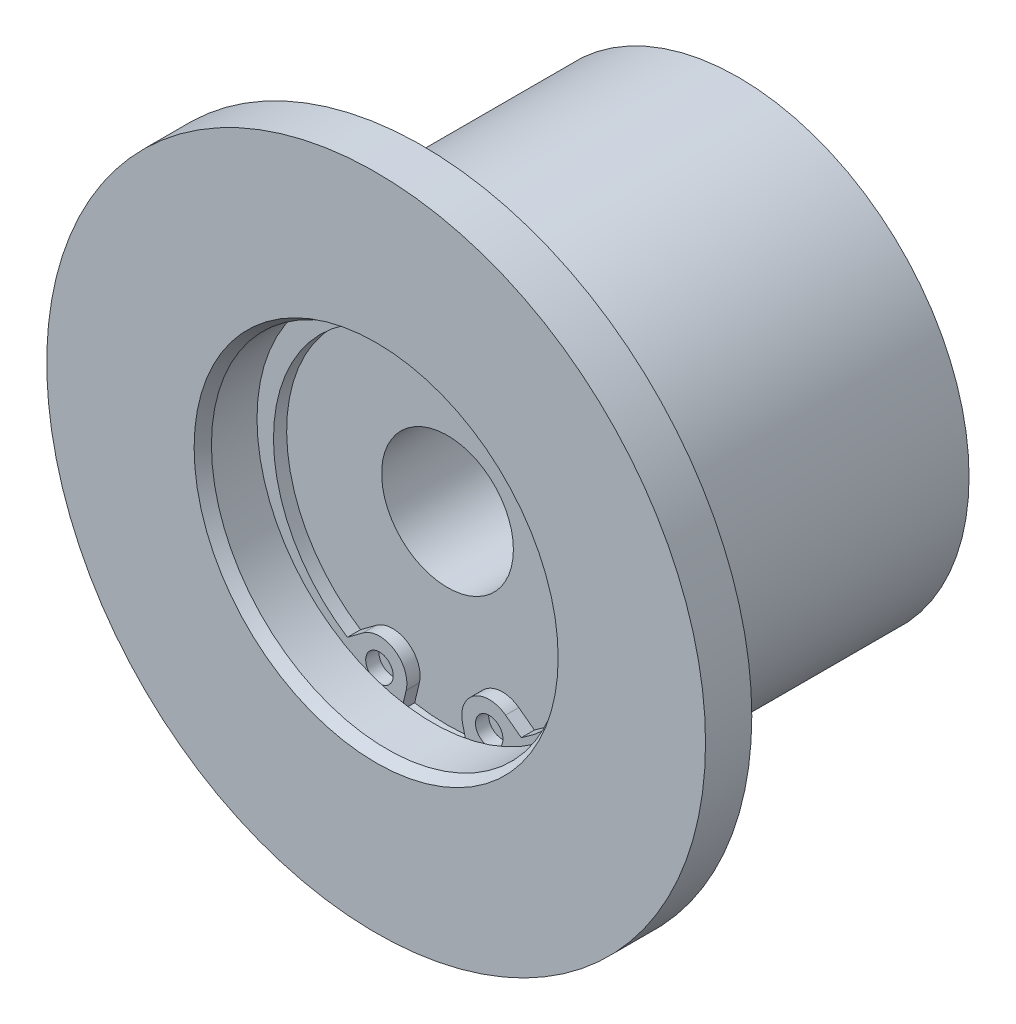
ISO-10303-21;
HEADER;
FILE_DESCRIPTION(('STEP AP214'),'2;1');
FILE_NAME('part.step','',(''),(''),'','','');
FILE_SCHEMA(('AUTOMOTIVE_DESIGN { 1 0 10303 214 1 1 1 1 }'));
ENDSEC;
DATA;
#1=APPLICATION_CONTEXT('core data for automotive mechanical design processes');
#2=APPLICATION_PROTOCOL_DEFINITION('international standard','automotive_design',2000,#1);
#3=PRODUCT_CONTEXT('',#1,'mechanical');
#4=PRODUCT('Part','Part','',(#3));
#5=PRODUCT_RELATED_PRODUCT_CATEGORY('part','',(#4));
#6=PRODUCT_DEFINITION_FORMATION('','',#4);
#7=PRODUCT_DEFINITION_CONTEXT('part definition',#1,'design');
#8=PRODUCT_DEFINITION('design','',#6,#7);
#9=PRODUCT_DEFINITION_SHAPE('','',#8);
#10=(LENGTH_UNIT() NAMED_UNIT(*) SI_UNIT(.MILLI.,.METRE.));
#11=(NAMED_UNIT(*) PLANE_ANGLE_UNIT() SI_UNIT($,.RADIAN.));
#12=(NAMED_UNIT(*) SI_UNIT($,.STERADIAN.) SOLID_ANGLE_UNIT());
#13=UNCERTAINTY_MEASURE_WITH_UNIT(LENGTH_MEASURE(1.E-05),#10,'distance_accuracy_value','');
#14=(GEOMETRIC_REPRESENTATION_CONTEXT(3) GLOBAL_UNCERTAINTY_ASSIGNED_CONTEXT((#13)) GLOBAL_UNIT_ASSIGNED_CONTEXT((#10,
#11,#12)) REPRESENTATION_CONTEXT('',''));
#15=CARTESIAN_POINT('',(0.,0.,0.));
#16=DIRECTION('',(0.,0.,1.));
#17=DIRECTION('',(1.,0.,0.));
#18=AXIS2_PLACEMENT_3D('',#15,#16,#17);
#19=CARTESIAN_POINT('',(0.,-0.95,11.2));
#20=DIRECTION('',(0.,0.,1.));
#21=DIRECTION('',(-1.,0.,0.));
#22=AXIS2_PLACEMENT_3D('',#19,#20,#21);
#23=CYLINDRICAL_SURFACE('',#22,14.65);
#24=CARTESIAN_POINT('',(0.,-0.95,10.));
#25=DIRECTION('',(0.,0.,-1.));
#26=DIRECTION('',(0.,-1.,0.));
#27=AXIS2_PLACEMENT_3D('',#24,#25,#26);
#28=CIRCLE('',#27,14.65);
#29=CARTESIAN_POINT('',(-7.91695293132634,-13.2765711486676,10.));
#30=VERTEX_POINT('',#29);
#31=CARTESIAN_POINT('',(7.91695293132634,-13.2765711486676,10.));
#32=VERTEX_POINT('',#31);
#33=EDGE_CURVE('E161',#30,#32,#28,.T.);
#34=ORIENTED_EDGE('',*,*,#33,.T.);
#35=DIRECTION('',(0.,0.,-1.));
#36=VECTOR('',#35,1.);
#37=CARTESIAN_POINT('',(7.91695293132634,-13.2765711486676,11.2));
#38=LINE('',#37,#36);
#39=CARTESIAN_POINT('',(7.91695293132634,-13.2765711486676,11.2));
#40=VERTEX_POINT('',#39);
#41=EDGE_CURVE('E101',#40,#32,#38,.T.);
#42=ORIENTED_EDGE('',*,*,#41,.F.);
#43=CARTESIAN_POINT('',(0.,-0.95,11.2));
#44=DIRECTION('',(0.,0.,-1.));
#45=DIRECTION('',(0.,-1.,0.));
#46=AXIS2_PLACEMENT_3D('',#43,#44,#45);
#47=CIRCLE('',#46,14.65);
#48=CARTESIAN_POINT('',(-7.91695293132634,-13.2765711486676,11.2));
#49=VERTEX_POINT('',#48);
#50=EDGE_CURVE('E102',#49,#40,#47,.T.);
#51=ORIENTED_EDGE('',*,*,#50,.F.);
#52=DIRECTION('',(0.,0.,-1.));
#53=VECTOR('',#52,1.);
#54=CARTESIAN_POINT('',(-7.91695293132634,-13.2765711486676,11.2));
#55=LINE('',#54,#53);
#56=EDGE_CURVE('E96',#49,#30,#55,.T.);
#57=ORIENTED_EDGE('',*,*,#56,.T.);
#58=EDGE_LOOP('',(#34,#42,#51,#57));
#59=FACE_BOUND('',#58,.T.);
#60=ADVANCED_FACE('F14',(#59),#23,.F.);
#61=CARTESIAN_POINT('',(6.49138441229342,-12.2169439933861,11.2));
#62=DIRECTION('',(-0.596553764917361,-0.802573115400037,0.));
#63=DIRECTION('',(-0.802573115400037,0.596553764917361,0.));
#64=AXIS2_PLACEMENT_3D('',#61,#62,#63);
#65=PLANE('',#64);
#66=DIRECTION('',(-0.802573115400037,0.596553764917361,0.));
#67=VECTOR('',#66,1.);
#68=CARTESIAN_POINT('',(6.49138441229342,-12.2169439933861,10.));
#69=LINE('',#68,#67);
#70=CARTESIAN_POINT('',(6.49138441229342,-12.2169439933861,10.));
#71=VERTEX_POINT('',#70);
#72=EDGE_CURVE('E145',#32,#71,#69,.T.);
#73=ORIENTED_EDGE('',*,*,#72,.T.);
#74=DIRECTION('',(0.,0.,-1.));
#75=VECTOR('',#74,1.);
#76=CARTESIAN_POINT('',(6.49138441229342,-12.2169439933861,11.2));
#77=LINE('',#76,#75);
#78=CARTESIAN_POINT('',(6.49138441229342,-12.2169439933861,11.2));
#79=VERTEX_POINT('',#78);
#80=EDGE_CURVE('E150',#79,#71,#77,.T.);
#81=ORIENTED_EDGE('',*,*,#80,.F.);
#82=DIRECTION('',(-0.802573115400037,0.596553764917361,0.));
#83=VECTOR('',#82,1.);
#84=CARTESIAN_POINT('',(6.49138441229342,-12.2169439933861,11.2));
#85=LINE('',#84,#83);
#86=EDGE_CURVE('E135',#40,#79,#85,.T.);
#87=ORIENTED_EDGE('',*,*,#86,.F.);
#88=ORIENTED_EDGE('',*,*,#41,.T.);
#89=EDGE_LOOP('',(#73,#81,#87,#88));
#90=FACE_BOUND('',#89,.T.);
#91=ADVANCED_FACE('F286',(#90),#65,.F.);
#92=CARTESIAN_POINT('',(5.,-14.2233767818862,11.2));
#93=DIRECTION('',(0.,0.,1.));
#94=DIRECTION('',(-1.,0.,0.));
#95=AXIS2_PLACEMENT_3D('',#92,#93,#94);
#96=CYLINDRICAL_SURFACE('',#95,2.5);
#97=CARTESIAN_POINT('',(5.,-14.2233767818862,10.));
#98=DIRECTION('',(0.,0.,1.));
#99=DIRECTION('',(1.,0.,0.));
#100=AXIS2_PLACEMENT_3D('',#97,#98,#99);
#101=CIRCLE('',#100,2.5);
#102=CARTESIAN_POINT('',(2.5678231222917,-14.8017500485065,10.));
#103=VERTEX_POINT('',#102);
#104=EDGE_CURVE('E131',#71,#103,#101,.T.);
#105=ORIENTED_EDGE('',*,*,#104,.T.);
#106=DIRECTION('',(0.,0.,-1.));
#107=VECTOR('',#106,1.);
#108=CARTESIAN_POINT('',(2.5678231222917,-14.8017500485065,11.2));
#109=LINE('',#108,#107);
#110=CARTESIAN_POINT('',(2.5678231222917,-14.8017500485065,11.2));
#111=VERTEX_POINT('',#110);
#112=EDGE_CURVE('E151',#111,#103,#109,.T.);
#113=ORIENTED_EDGE('',*,*,#112,.F.);
#114=CARTESIAN_POINT('',(5.,-14.2233767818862,11.2));
#115=DIRECTION('',(0.,0.,1.));
#116=DIRECTION('',(1.,0.,0.));
#117=AXIS2_PLACEMENT_3D('',#114,#115,#116);
#118=CIRCLE('',#117,2.5);
#119=EDGE_CURVE('E166',#79,#111,#118,.T.);
#120=ORIENTED_EDGE('',*,*,#119,.F.);
#121=ORIENTED_EDGE('',*,*,#80,.T.);
#122=EDGE_LOOP('',(#105,#113,#120,#121));
#123=FACE_BOUND('',#122,.T.);
#124=ADVANCED_FACE('F283',(#123),#96,.T.);
#125=CARTESIAN_POINT('',(-2.56782312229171,-14.8017500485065,11.2));
#126=DIRECTION('',(-0.97287075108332,0.231349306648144,0.));
#127=DIRECTION('',(0.,0.,1.));
#128=AXIS2_PLACEMENT_3D('',#125,#126,#127);
#129=PLANE('',#128);
#130=DIRECTION('',(0.,0.,1.));
#131=VECTOR('',#130,1.);
#132=CARTESIAN_POINT('',(-2.99125499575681,-16.5823669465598,15.1183293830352));
#133=LINE('',#132,#131);
#134=CARTESIAN_POINT('',(-2.99125499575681,-16.5823669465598,10.));
#135=VERTEX_POINT('',#134);
#136=CARTESIAN_POINT('',(-2.99125499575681,-16.5823669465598,11.2));
#137=VERTEX_POINT('',#136);
#138=EDGE_CURVE('E175',#135,#137,#133,.T.);
#139=ORIENTED_EDGE('',*,*,#138,.F.);
#140=DIRECTION('',(0.231349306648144,0.97287075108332,0.));
#141=VECTOR('',#140,1.);
#142=CARTESIAN_POINT('',(-2.56782312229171,-14.8017500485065,10.));
#143=LINE('',#142,#141);
#144=CARTESIAN_POINT('',(-2.56782312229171,-14.8017500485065,10.));
#145=VERTEX_POINT('',#144);
#146=EDGE_CURVE('E152',#135,#145,#143,.T.);
#147=ORIENTED_EDGE('',*,*,#146,.T.);
#148=DIRECTION('',(0.,0.,-1.));
#149=VECTOR('',#148,1.);
#150=CARTESIAN_POINT('',(-2.56782312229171,-14.8017500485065,11.2));
#151=LINE('',#150,#149);
#152=CARTESIAN_POINT('',(-2.56782312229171,-14.8017500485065,11.2));
#153=VERTEX_POINT('',#152);
#154=EDGE_CURVE('E171',#153,#145,#151,.T.);
#155=ORIENTED_EDGE('',*,*,#154,.F.);
#156=DIRECTION('',(0.231349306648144,0.97287075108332,0.));
#157=VECTOR('',#156,1.);
#158=CARTESIAN_POINT('',(-2.56782312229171,-14.8017500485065,11.2));
#159=LINE('',#158,#157);
#160=EDGE_CURVE('E119',#137,#153,#159,.T.);
#161=ORIENTED_EDGE('',*,*,#160,.F.);
#162=EDGE_LOOP('',(#139,#147,#155,#161));
#163=FACE_BOUND('',#162,.T.);
#164=ADVANCED_FACE('F296',(#163),#129,.F.);
#165=CARTESIAN_POINT('',(0.,-0.95,11.2));
#166=DIRECTION('',(0.,0.,-1.));
#167=DIRECTION('',(0.,-1.,0.));
#168=AXIS2_PLACEMENT_3D('',#165,#166,#167);
#169=PLANE('',#168);
#170=CARTESIAN_POINT('',(5.,-14.2233767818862,11.2));
#171=DIRECTION('',(0.,0.,1.));
#172=DIRECTION('',(1.,0.,0.));
#173=AXIS2_PLACEMENT_3D('',#170,#171,#172);
#174=CIRCLE('',#173,1.25);
#175=CARTESIAN_POINT('',(6.25,-14.2233767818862,11.2));
#176=VERTEX_POINT('',#175);
#177=EDGE_CURVE('E137',#176,#176,#174,.T.);
#178=ORIENTED_EDGE('',*,*,#177,.F.);
#179=EDGE_LOOP('',(#178));
#180=FACE_BOUND('',#179,.T.);
#181=CARTESIAN_POINT('',(-5.,-14.2233767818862,11.2));
#182=DIRECTION('',(0.,0.,-1.));
#183=DIRECTION('',(1.,0.,0.));
#184=AXIS2_PLACEMENT_3D('',#181,#182,#183);
#185=CIRCLE('',#184,1.25);
#186=CARTESIAN_POINT('',(-3.75,-14.2233767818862,11.2));
#187=VERTEX_POINT('',#186);
#188=EDGE_CURVE('E121',#187,#187,#185,.T.);
#189=ORIENTED_EDGE('',*,*,#188,.T.);
#190=EDGE_LOOP('',(#189));
#191=FACE_BOUND('',#190,.T.);
#192=CARTESIAN_POINT('',(0.,0.,11.2));
#193=DIRECTION('',(0.,0.,-1.));
#194=DIRECTION('',(-1.,0.,0.));
#195=AXIS2_PLACEMENT_3D('',#192,#193,#194);
#196=CIRCLE('',#195,16.85);
#197=CARTESIAN_POINT('',(2.99125499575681,-16.5823669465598,11.2));
#198=VERTEX_POINT('',#197);
#199=EDGE_CURVE('E9',#137,#198,#196,.T.);
#200=ORIENTED_EDGE('',*,*,#199,.F.);
#201=ORIENTED_EDGE('',*,*,#160,.T.);
#202=CARTESIAN_POINT('',(-5.,-14.2233767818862,11.2));
#203=DIRECTION('',(0.,0.,1.));
#204=DIRECTION('',(-1.,0.,0.));
#205=AXIS2_PLACEMENT_3D('',#202,#203,#204);
#206=CIRCLE('',#205,2.5);
#207=CARTESIAN_POINT('',(-6.49138441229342,-12.2169439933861,11.2));
#208=VERTEX_POINT('',#207);
#209=EDGE_CURVE('E108',#153,#208,#206,.T.);
#210=ORIENTED_EDGE('',*,*,#209,.T.);
#211=DIRECTION('',(-0.802573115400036,-0.596553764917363,0.));
#212=VECTOR('',#211,1.);
#213=CARTESIAN_POINT('',(-6.49138441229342,-12.2169439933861,11.2));
#214=LINE('',#213,#212);
#215=EDGE_CURVE('E91',#208,#49,#214,.T.);
#216=ORIENTED_EDGE('',*,*,#215,.T.);
#217=ORIENTED_EDGE('',*,*,#50,.T.);
#218=ORIENTED_EDGE('',*,*,#86,.T.);
#219=ORIENTED_EDGE('',*,*,#119,.T.);
#220=DIRECTION('',(0.231349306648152,-0.972870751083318,0.));
#221=VECTOR('',#220,1.);
#222=CARTESIAN_POINT('',(2.5678231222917,-14.8017500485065,11.2));
#223=LINE('',#222,#221);
#224=EDGE_CURVE('E127',#111,#198,#223,.T.);
#225=ORIENTED_EDGE('',*,*,#224,.T.);
#226=EDGE_LOOP('',(#200,#201,#210,#216,#217,#218,#219,#225));
#227=FACE_BOUND('',#226,.T.);
#228=ADVANCED_FACE('F117',(#180,#191,#227),#169,.F.);
#229=CARTESIAN_POINT('',(5.,-14.2233767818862,11.2));
#230=DIRECTION('',(0.,0.,1.));
#231=DIRECTION('',(-1.,0.,0.));
#232=AXIS2_PLACEMENT_3D('',#229,#230,#231);
#233=CYLINDRICAL_SURFACE('',#232,1.25);
#234=CARTESIAN_POINT('',(5.,-14.2233767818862,10.));
#235=DIRECTION('',(0.,0.,1.));
#236=DIRECTION('',(1.,0.,0.));
#237=AXIS2_PLACEMENT_3D('',#234,#235,#236);
#238=CIRCLE('',#237,1.25);
#239=CARTESIAN_POINT('',(6.25,-14.2233767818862,10.));
#240=VERTEX_POINT('',#239);
#241=EDGE_CURVE('E114',#240,#240,#238,.T.);
#242=ORIENTED_EDGE('',*,*,#241,.F.);
#243=EDGE_LOOP('',(#242));
#244=FACE_BOUND('',#243,.T.);
#245=ORIENTED_EDGE('',*,*,#177,.T.);
#246=EDGE_LOOP('',(#245));
#247=FACE_BOUND('',#246,.T.);
#248=ADVANCED_FACE('F304',(#244,#247),#233,.F.);
#249=CARTESIAN_POINT('',(-5.,-14.2233767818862,11.2));
#250=DIRECTION('',(0.,0.,1.));
#251=DIRECTION('',(-1.,0.,0.));
#252=AXIS2_PLACEMENT_3D('',#249,#250,#251);
#253=CYLINDRICAL_SURFACE('',#252,1.25);
#254=CARTESIAN_POINT('',(-5.,-14.2233767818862,10.));
#255=DIRECTION('',(0.,0.,-1.));
#256=DIRECTION('',(1.,0.,0.));
#257=AXIS2_PLACEMENT_3D('',#254,#255,#256);
#258=CIRCLE('',#257,1.25);
#259=CARTESIAN_POINT('',(-3.75,-14.2233767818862,10.));
#260=VERTEX_POINT('',#259);
#261=EDGE_CURVE('E140',#260,#260,#258,.T.);
#262=ORIENTED_EDGE('',*,*,#261,.T.);
#263=EDGE_LOOP('',(#262));
#264=FACE_BOUND('',#263,.T.);
#265=ORIENTED_EDGE('',*,*,#188,.F.);
#266=EDGE_LOOP('',(#265));
#267=FACE_BOUND('',#266,.T.);
#268=ADVANCED_FACE('F326',(#264,#267),#253,.F.);
#269=CARTESIAN_POINT('',(-6.49138441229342,-12.2169439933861,11.2));
#270=DIRECTION('',(0.596553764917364,-0.802573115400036,0.));
#271=DIRECTION('',(0.,0.,-1.));
#272=AXIS2_PLACEMENT_3D('',#269,#270,#271);
#273=PLANE('',#272);
#274=DIRECTION('',(-0.802573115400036,-0.596553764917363,0.));
#275=VECTOR('',#274,1.);
#276=CARTESIAN_POINT('',(-6.49138441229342,-12.2169439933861,10.));
#277=LINE('',#276,#275);
#278=CARTESIAN_POINT('',(-6.49138441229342,-12.2169439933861,10.));
#279=VERTEX_POINT('',#278);
#280=EDGE_CURVE('E113',#279,#30,#277,.T.);
#281=ORIENTED_EDGE('',*,*,#280,.T.);
#282=ORIENTED_EDGE('',*,*,#56,.F.);
#283=ORIENTED_EDGE('',*,*,#215,.F.);
#284=DIRECTION('',(0.,0.,-1.));
#285=VECTOR('',#284,1.);
#286=CARTESIAN_POINT('',(-6.49138441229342,-12.2169439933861,11.2));
#287=LINE('',#286,#285);
#288=EDGE_CURVE('E94',#208,#279,#287,.T.);
#289=ORIENTED_EDGE('',*,*,#288,.T.);
#290=EDGE_LOOP('',(#281,#282,#283,#289));
#291=FACE_BOUND('',#290,.T.);
#292=ADVANCED_FACE('F93',(#291),#273,.F.);
#293=CARTESIAN_POINT('',(-5.,-14.2233767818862,11.2));
#294=DIRECTION('',(0.,0.,1.));
#295=DIRECTION('',(-1.,0.,0.));
#296=AXIS2_PLACEMENT_3D('',#293,#294,#295);
#297=CYLINDRICAL_SURFACE('',#296,2.5);
#298=CARTESIAN_POINT('',(-5.,-14.2233767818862,10.));
#299=DIRECTION('',(0.,0.,1.));
#300=DIRECTION('',(-1.,0.,0.));
#301=AXIS2_PLACEMENT_3D('',#298,#299,#300);
#302=CIRCLE('',#301,2.5);
#303=EDGE_CURVE('E110',#145,#279,#302,.T.);
#304=ORIENTED_EDGE('',*,*,#303,.T.);
#305=ORIENTED_EDGE('',*,*,#288,.F.);
#306=ORIENTED_EDGE('',*,*,#209,.F.);
#307=ORIENTED_EDGE('',*,*,#154,.T.);
#308=EDGE_LOOP('',(#304,#305,#306,#307));
#309=FACE_BOUND('',#308,.T.);
#310=ADVANCED_FACE('F106',(#309),#297,.T.);
#311=CARTESIAN_POINT('',(2.5678231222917,-14.8017500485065,11.2));
#312=DIRECTION('',(0.972870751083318,0.231349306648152,0.));
#313=DIRECTION('',(0.,0.,-1.));
#314=AXIS2_PLACEMENT_3D('',#311,#312,#313);
#315=PLANE('',#314);
#316=DIRECTION('',(0.,0.,1.));
#317=VECTOR('',#316,1.);
#318=CARTESIAN_POINT('',(2.99125499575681,-16.5823669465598,15.1183293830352));
#319=LINE('',#318,#317);
#320=CARTESIAN_POINT('',(2.99125499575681,-16.5823669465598,10.));
#321=VERTEX_POINT('',#320);
#322=EDGE_CURVE('E18',#198,#321,#319,.F.);
#323=ORIENTED_EDGE('',*,*,#322,.F.);
#324=ORIENTED_EDGE('',*,*,#224,.F.);
#325=ORIENTED_EDGE('',*,*,#112,.T.);
#326=DIRECTION('',(0.231349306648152,-0.972870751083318,0.));
#327=VECTOR('',#326,1.);
#328=CARTESIAN_POINT('',(2.5678231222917,-14.8017500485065,10.));
#329=LINE('',#328,#327);
#330=EDGE_CURVE('E32',#103,#321,#329,.T.);
#331=ORIENTED_EDGE('',*,*,#330,.T.);
#332=EDGE_LOOP('',(#323,#324,#325,#331));
#333=FACE_BOUND('',#332,.T.);
#334=ADVANCED_FACE('F265',(#333),#315,.F.);
#335=CARTESIAN_POINT('',(0.,6.,10.));
#336=DIRECTION('',(0.,0.,-1.));
#337=DIRECTION('',(-1.,0.,0.));
#338=AXIS2_PLACEMENT_3D('',#335,#336,#337);
#339=PLANE('',#338);
#340=ORIENTED_EDGE('',*,*,#241,.T.);
#341=EDGE_LOOP('',(#340));
#342=FACE_BOUND('',#341,.T.);
#343=ADVANCED_FACE('F257',(#342),#339,.F.);
#344=ORIENTED_EDGE('',*,*,#261,.F.);
#345=EDGE_LOOP('',(#344));
#346=FACE_BOUND('',#345,.T.);
#347=ADVANCED_FACE('F256',(#346),#339,.F.);
#348=CARTESIAN_POINT('',(0.,0.,11.5));
#349=DIRECTION('',(0.,0.,1.));
#350=DIRECTION('',(1.,0.,0.));
#351=AXIS2_PLACEMENT_3D('',#348,#349,#350);
#352=CONICAL_SURFACE('',#351,21.,1.48352986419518);
#353=CARTESIAN_POINT('',(0.,0.,12.2873979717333));
#354=DIRECTION('',(0.,0.,1.));
#355=DIRECTION('',(1.,0.,0.));
#356=AXIS2_PLACEMENT_3D('',#353,#354,#355);
#357=CIRCLE('',#356,30.);
#358=CARTESIAN_POINT('',(30.,0.,12.2873979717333));
#359=VERTEX_POINT('',#358);
#360=EDGE_CURVE('E210',#359,#359,#357,.T.);
#361=ORIENTED_EDGE('',*,*,#360,.F.);
#362=EDGE_LOOP('',(#361));
#363=FACE_BOUND('',#362,.T.);
#364=CARTESIAN_POINT('',(0.,0.,11.5));
#365=DIRECTION('',(0.,0.,1.));
#366=DIRECTION('',(1.,0.,0.));
#367=AXIS2_PLACEMENT_3D('',#364,#365,#366);
#368=CIRCLE('',#367,21.);
#369=CARTESIAN_POINT('',(21.,0.,11.5));
#370=VERTEX_POINT('',#369);
#371=EDGE_CURVE('E141',#370,#370,#368,.T.);
#372=ORIENTED_EDGE('',*,*,#371,.T.);
#373=EDGE_LOOP('',(#372));
#374=FACE_BOUND('',#373,.T.);
#375=ADVANCED_FACE('F216',(#363,#374),#352,.T.);
#376=CARTESIAN_POINT('',(0.,0.,15.1183293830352));
#377=DIRECTION('',(0.,0.,1.));
#378=DIRECTION('',(1.,0.,0.));
#379=AXIS2_PLACEMENT_3D('',#376,#377,#378);
#380=CYLINDRICAL_SURFACE('',#379,30.);
#381=CARTESIAN_POINT('',(0.,0.,16.5));
#382=DIRECTION('',(0.,0.,1.));
#383=DIRECTION('',(1.,0.,0.));
#384=AXIS2_PLACEMENT_3D('',#381,#382,#383);
#385=CIRCLE('',#384,30.);
#386=CARTESIAN_POINT('',(30.,0.,16.5));
#387=VERTEX_POINT('',#386);
#388=EDGE_CURVE('E207',#387,#387,#385,.T.);
#389=ORIENTED_EDGE('',*,*,#388,.F.);
#390=EDGE_LOOP('',(#389));
#391=FACE_BOUND('',#390,.T.);
#392=ORIENTED_EDGE('',*,*,#360,.T.);
#393=EDGE_LOOP('',(#392));
#394=FACE_BOUND('',#393,.T.);
#395=ADVANCED_FACE('F221',(#391,#394),#380,.T.);
#396=CARTESIAN_POINT('',(0.,0.,15.1183293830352));
#397=DIRECTION('',(0.,0.,1.));
#398=DIRECTION('',(1.,0.,0.));
#399=AXIS2_PLACEMENT_3D('',#396,#397,#398);
#400=CYLINDRICAL_SURFACE('',#399,21.);
#401=ORIENTED_EDGE('',*,*,#371,.F.);
#402=EDGE_LOOP('',(#401));
#403=FACE_BOUND('',#402,.T.);
#404=CARTESIAN_POINT('',(0.,0.,-16.5));
#405=DIRECTION('',(0.,0.,1.));
#406=DIRECTION('',(1.,0.,0.));
#407=AXIS2_PLACEMENT_3D('',#404,#405,#406);
#408=CIRCLE('',#407,21.);
#409=CARTESIAN_POINT('',(21.,0.,-16.5));
#410=VERTEX_POINT('',#409);
#411=EDGE_CURVE('E177',#410,#410,#408,.T.);
#412=ORIENTED_EDGE('',*,*,#411,.T.);
#413=EDGE_LOOP('',(#412));
#414=FACE_BOUND('',#413,.T.);
#415=ADVANCED_FACE('F16',(#403,#414),#400,.T.);
#416=CARTESIAN_POINT('',(0.,30.,16.5));
#417=DIRECTION('',(0.,0.,-1.));
#418=DIRECTION('',(-1.,0.,0.));
#419=AXIS2_PLACEMENT_3D('',#416,#417,#418);
#420=PLANE('',#419);
#421=CARTESIAN_POINT('',(0.,0.,16.5));
#422=DIRECTION('',(0.,0.,1.));
#423=DIRECTION('',(1.,0.,0.));
#424=AXIS2_PLACEMENT_3D('',#421,#422,#423);
#425=CIRCLE('',#424,16.5773502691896);
#426=CARTESIAN_POINT('',(16.5773502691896,0.,16.5));
#427=VERTEX_POINT('',#426);
#428=EDGE_CURVE('E204',#427,#427,#425,.T.);
#429=ORIENTED_EDGE('',*,*,#428,.F.);
#430=EDGE_LOOP('',(#429));
#431=FACE_BOUND('',#430,.T.);
#432=ORIENTED_EDGE('',*,*,#388,.T.);
#433=EDGE_LOOP('',(#432));
#434=FACE_BOUND('',#433,.T.);
#435=ADVANCED_FACE('F220',(#431,#434),#420,.F.);
#436=CARTESIAN_POINT('',(0.,13.,-16.5));
#437=DIRECTION('',(0.,0.,1.));
#438=DIRECTION('',(1.,0.,0.));
#439=AXIS2_PLACEMENT_3D('',#436,#437,#438);
#440=PLANE('',#439);
#441=ORIENTED_EDGE('',*,*,#411,.F.);
#442=EDGE_LOOP('',(#441));
#443=FACE_BOUND('',#442,.T.);
#444=CARTESIAN_POINT('',(0.,0.,-16.5));
#445=DIRECTION('',(0.,0.,1.));
#446=DIRECTION('',(1.,0.,0.));
#447=AXIS2_PLACEMENT_3D('',#444,#445,#446);
#448=CIRCLE('',#447,13.);
#449=CARTESIAN_POINT('',(13.,0.,-16.5));
#450=VERTEX_POINT('',#449);
#451=EDGE_CURVE('E180',#450,#450,#448,.T.);
#452=ORIENTED_EDGE('',*,*,#451,.T.);
#453=EDGE_LOOP('',(#452));
#454=FACE_BOUND('',#453,.T.);
#455=ADVANCED_FACE('F224',(#443,#454),#440,.F.);
#456=CARTESIAN_POINT('',(0.,0.,16.5));
#457=DIRECTION('',(0.,0.,1.));
#458=DIRECTION('',(1.,0.,0.));
#459=AXIS2_PLACEMENT_3D('',#456,#457,#458);
#460=CONICAL_SURFACE('',#459,16.5773502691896,0.5235987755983);
#461=CARTESIAN_POINT('',(0.,0.,15.5));
#462=DIRECTION('',(0.,0.,1.));
#463=DIRECTION('',(1.,0.,0.));
#464=AXIS2_PLACEMENT_3D('',#461,#462,#463);
#465=CIRCLE('',#464,16.);
#466=CARTESIAN_POINT('',(16.,0.,15.5));
#467=VERTEX_POINT('',#466);
#468=EDGE_CURVE('E201',#467,#467,#465,.T.);
#469=ORIENTED_EDGE('',*,*,#468,.F.);
#470=EDGE_LOOP('',(#469));
#471=FACE_BOUND('',#470,.T.);
#472=ORIENTED_EDGE('',*,*,#428,.T.);
#473=EDGE_LOOP('',(#472));
#474=FACE_BOUND('',#473,.T.);
#475=ADVANCED_FACE('F227',(#471,#474),#460,.F.);
#476=CARTESIAN_POINT('',(0.,0.,15.1183293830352));
#477=DIRECTION('',(0.,0.,1.));
#478=DIRECTION('',(1.,0.,0.));
#479=AXIS2_PLACEMENT_3D('',#476,#477,#478);
#480=CYLINDRICAL_SURFACE('',#479,13.);
#481=ORIENTED_EDGE('',*,*,#451,.F.);
#482=EDGE_LOOP('',(#481));
#483=FACE_BOUND('',#482,.T.);
#484=CARTESIAN_POINT('',(0.,0.,-10.));
#485=DIRECTION('',(0.,0.,1.));
#486=DIRECTION('',(1.,0.,0.));
#487=AXIS2_PLACEMENT_3D('',#484,#485,#486);
#488=CIRCLE('',#487,13.);
#489=CARTESIAN_POINT('',(13.,0.,-10.));
#490=VERTEX_POINT('',#489);
#491=EDGE_CURVE('E183',#490,#490,#488,.T.);
#492=ORIENTED_EDGE('',*,*,#491,.T.);
#493=EDGE_LOOP('',(#492));
#494=FACE_BOUND('',#493,.T.);
#495=ADVANCED_FACE('F231',(#483,#494),#480,.F.);
#496=CARTESIAN_POINT('',(0.,0.,15.1183293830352));
#497=DIRECTION('',(0.,0.,1.));
#498=DIRECTION('',(1.,0.,0.));
#499=AXIS2_PLACEMENT_3D('',#496,#497,#498);
#500=CYLINDRICAL_SURFACE('',#499,16.);
#501=CARTESIAN_POINT('',(0.,0.,11.35));
#502=DIRECTION('',(0.,0.,1.));
#503=DIRECTION('',(1.,0.,0.));
#504=AXIS2_PLACEMENT_3D('',#501,#502,#503);
#505=CIRCLE('',#504,16.);
#506=CARTESIAN_POINT('',(16.,0.,11.35));
#507=VERTEX_POINT('',#506);
#508=EDGE_CURVE('E198',#507,#507,#505,.T.);
#509=ORIENTED_EDGE('',*,*,#508,.F.);
#510=EDGE_LOOP('',(#509));
#511=FACE_BOUND('',#510,.T.);
#512=ORIENTED_EDGE('',*,*,#468,.T.);
#513=EDGE_LOOP('',(#512));
#514=FACE_BOUND('',#513,.T.);
#515=ADVANCED_FACE('F234',(#511,#514),#500,.F.);
#516=CARTESIAN_POINT('',(0.,13.,-10.));
#517=DIRECTION('',(0.,0.,1.));
#518=DIRECTION('',(1.,0.,0.));
#519=AXIS2_PLACEMENT_3D('',#516,#517,#518);
#520=PLANE('',#519);
#521=ORIENTED_EDGE('',*,*,#491,.F.);
#522=EDGE_LOOP('',(#521));
#523=FACE_BOUND('',#522,.T.);
#524=CARTESIAN_POINT('',(0.,0.,-10.));
#525=DIRECTION('',(0.,0.,1.));
#526=DIRECTION('',(1.,0.,0.));
#527=AXIS2_PLACEMENT_3D('',#524,#525,#526);
#528=CIRCLE('',#527,6.);
#529=CARTESIAN_POINT('',(6.,0.,-10.));
#530=VERTEX_POINT('',#529);
#531=EDGE_CURVE('E186',#530,#530,#528,.T.);
#532=ORIENTED_EDGE('',*,*,#531,.T.);
#533=EDGE_LOOP('',(#532));
#534=FACE_BOUND('',#533,.T.);
#535=ADVANCED_FACE('F238',(#523,#534),#520,.F.);
#536=CARTESIAN_POINT('',(0.,16.85,11.35));
#537=DIRECTION('',(0.,0.,1.));
#538=DIRECTION('',(1.,0.,0.));
#539=AXIS2_PLACEMENT_3D('',#536,#537,#538);
#540=PLANE('',#539);
#541=CARTESIAN_POINT('',(0.,0.,11.35));
#542=DIRECTION('',(0.,0.,1.));
#543=DIRECTION('',(1.,0.,0.));
#544=AXIS2_PLACEMENT_3D('',#541,#542,#543);
#545=CIRCLE('',#544,16.85);
#546=CARTESIAN_POINT('',(16.85,0.,11.35));
#547=VERTEX_POINT('',#546);
#548=EDGE_CURVE('E195',#547,#547,#545,.T.);
#549=ORIENTED_EDGE('',*,*,#548,.F.);
#550=EDGE_LOOP('',(#549));
#551=FACE_BOUND('',#550,.T.);
#552=ORIENTED_EDGE('',*,*,#508,.T.);
#553=EDGE_LOOP('',(#552));
#554=FACE_BOUND('',#553,.T.);
#555=ADVANCED_FACE('F241',(#551,#554),#540,.F.);
#556=CARTESIAN_POINT('',(0.,0.,15.1183293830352));
#557=DIRECTION('',(0.,0.,1.));
#558=DIRECTION('',(1.,0.,0.));
#559=AXIS2_PLACEMENT_3D('',#556,#557,#558);
#560=CYLINDRICAL_SURFACE('',#559,16.85);
#561=ORIENTED_EDGE('',*,*,#548,.T.);
#562=EDGE_LOOP('',(#561));
#563=FACE_BOUND('',#562,.T.);
#564=ORIENTED_EDGE('',*,*,#199,.T.);
#565=ORIENTED_EDGE('',*,*,#322,.T.);
#566=CARTESIAN_POINT('',(0.,0.,10.));
#567=DIRECTION('',(0.,0.,1.));
#568=DIRECTION('',(1.,0.,0.));
#569=AXIS2_PLACEMENT_3D('',#566,#567,#568);
#570=CIRCLE('',#569,16.85);
#571=EDGE_CURVE('E192',#135,#321,#570,.T.);
#572=ORIENTED_EDGE('',*,*,#571,.F.);
#573=ORIENTED_EDGE('',*,*,#138,.T.);
#574=EDGE_LOOP('',(#564,#565,#572,#573));
#575=FACE_BOUND('',#574,.T.);
#576=ADVANCED_FACE('F249',(#563,#575),#560,.F.);
#577=CARTESIAN_POINT('',(0.,0.,15.1183293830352));
#578=DIRECTION('',(0.,0.,1.));
#579=DIRECTION('',(1.,0.,0.));
#580=AXIS2_PLACEMENT_3D('',#577,#578,#579);
#581=CYLINDRICAL_SURFACE('',#580,6.);
#582=ORIENTED_EDGE('',*,*,#531,.F.);
#583=EDGE_LOOP('',(#582));
#584=FACE_BOUND('',#583,.T.);
#585=CARTESIAN_POINT('',(0.,0.,10.));
#586=DIRECTION('',(0.,0.,1.));
#587=DIRECTION('',(1.,0.,0.));
#588=AXIS2_PLACEMENT_3D('',#585,#586,#587);
#589=CIRCLE('',#588,6.);
#590=CARTESIAN_POINT('',(6.,0.,10.));
#591=VERTEX_POINT('',#590);
#592=EDGE_CURVE('E189',#591,#591,#589,.T.);
#593=ORIENTED_EDGE('',*,*,#592,.T.);
#594=EDGE_LOOP('',(#593));
#595=FACE_BOUND('',#594,.T.);
#596=ADVANCED_FACE('F245',(#584,#595),#581,.F.);
#597=ORIENTED_EDGE('',*,*,#592,.F.);
#598=EDGE_LOOP('',(#597));
#599=FACE_BOUND('',#598,.T.);
#600=ORIENTED_EDGE('',*,*,#571,.T.);
#601=ORIENTED_EDGE('',*,*,#330,.F.);
#602=ORIENTED_EDGE('',*,*,#104,.F.);
#603=ORIENTED_EDGE('',*,*,#72,.F.);
#604=ORIENTED_EDGE('',*,*,#33,.F.);
#605=ORIENTED_EDGE('',*,*,#280,.F.);
#606=ORIENTED_EDGE('',*,*,#303,.F.);
#607=ORIENTED_EDGE('',*,*,#146,.F.);
#608=EDGE_LOOP('',(#600,#601,#602,#603,#604,#605,#606,#607));
#609=FACE_BOUND('',#608,.T.);
#610=ADVANCED_FACE('F248',(#599,#609),#339,.F.);
#611=CLOSED_SHELL('',(#60,#91,#124,#164,#228,#248,#268,#292,#310,#334,#343,#347,#375,#395,#415,
#435,#455,#475,#495,#515,#535,#555,#576,#596,#610));
#612=MANIFOLD_SOLID_BREP('B1',#611);
#613=ADVANCED_BREP_SHAPE_REPRESENTATION('',(#18,#612),#14);
#614=SHAPE_DEFINITION_REPRESENTATION(#9,#613);
ENDSEC;
END-ISO-10303-21;
